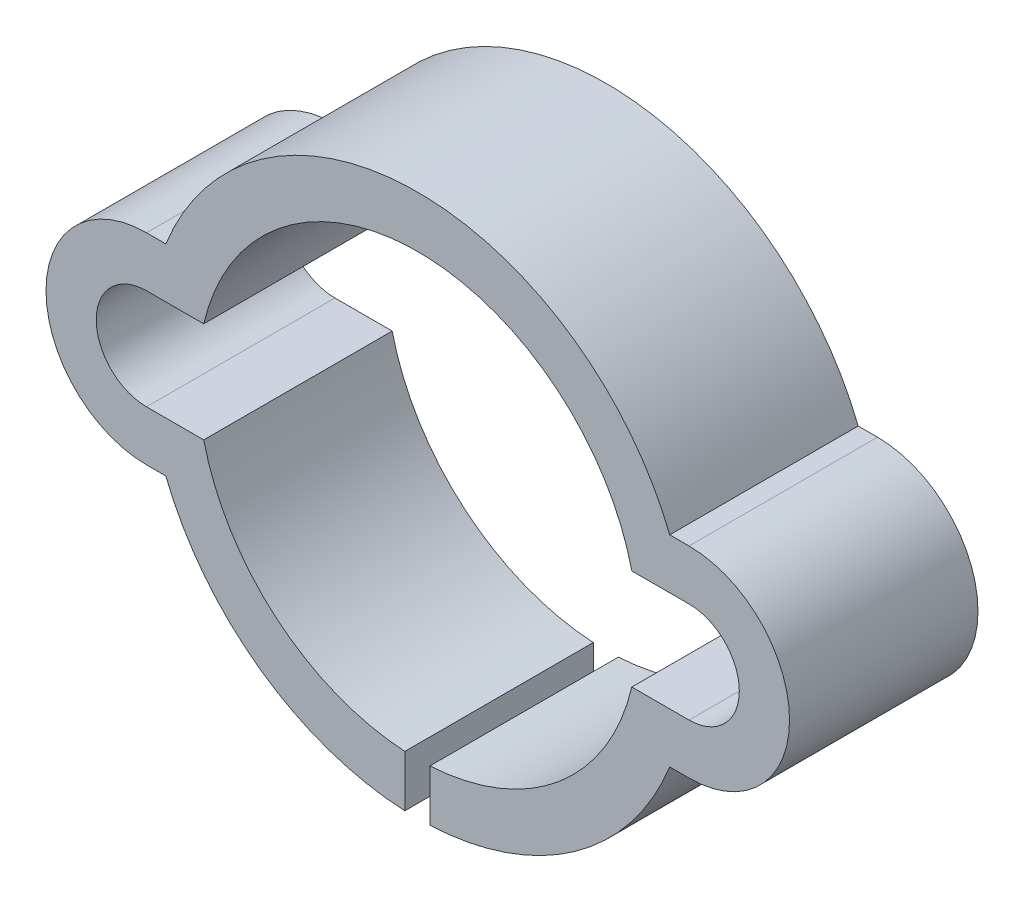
from build123d import *

# Parameters (mm, degrees)
BOSS_EXTRUDE1_DEPTH = 3


with BuildPart() as part:
    # Sketch1 → Boss-Extrude1 (new body)
    with BuildSketch(Plane.XY):
        with BuildLine():
            Line((-4.318374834, 0.8), (-3.407345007, 0.8))
            ThreePointArc((-3.407345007, 0.8), (0, 3.5), (3.407345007, 0.8))
            Line((3.407345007, 0.8), (4.318374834, 0.8))
            ThreePointArc((4.318374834, 0.8), (5.118374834, 0), (4.318374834, -0.8))
            Line((4.318374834, -0.8), (3.407345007, -0.8))
            ThreePointArc((3.407345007, -0.8), (2.248608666, -2.682118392), (0.193174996, -3.494664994))
            Line((0.193174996, -3.494664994), (0.193174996, -4.314051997))
            ThreePointArc((0.193174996, -4.314051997), (2.502070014, -3.519660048), (4.011029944, -1.6))
            Line((4.011029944, -1.6), (4.318374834, -1.6))
            ThreePointArc((4.318374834, -1.6), (5.918374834, 0), (4.318374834, 1.6))
            Line((4.318374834, 1.6), (4.011029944, 1.6))
            ThreePointArc((4.011029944, 1.6), (0, 4.318374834), (-4.011029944, 1.6))
            Line((-4.011029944, 1.6), (-4.318374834, 1.6))
            ThreePointArc((-4.318374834, 1.6), (-5.918374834, 0), (-4.318374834, -1.6))
            Line((-4.318374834, -1.6), (-4.011029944, -1.6))
            ThreePointArc((-4.011029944, -1.6), (-2.507277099, -3.51595261), (-0.205945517, -4.313461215))
            Line((-0.205945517, -4.313461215), (-0.205945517, -3.493935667))
            ThreePointArc((-0.205945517, -3.493935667), (-2.253506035, -2.678004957), (-3.407345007, -0.8))
            Line((-3.407345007, -0.8), (-4.318374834, -0.8))
            ThreePointArc((-4.318374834, -0.8), (-5.118374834, 0), (-4.318374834, 0.8))
        make_face()
    extrude(amount=BOSS_EXTRUDE1_DEPTH)


solid = part.part
